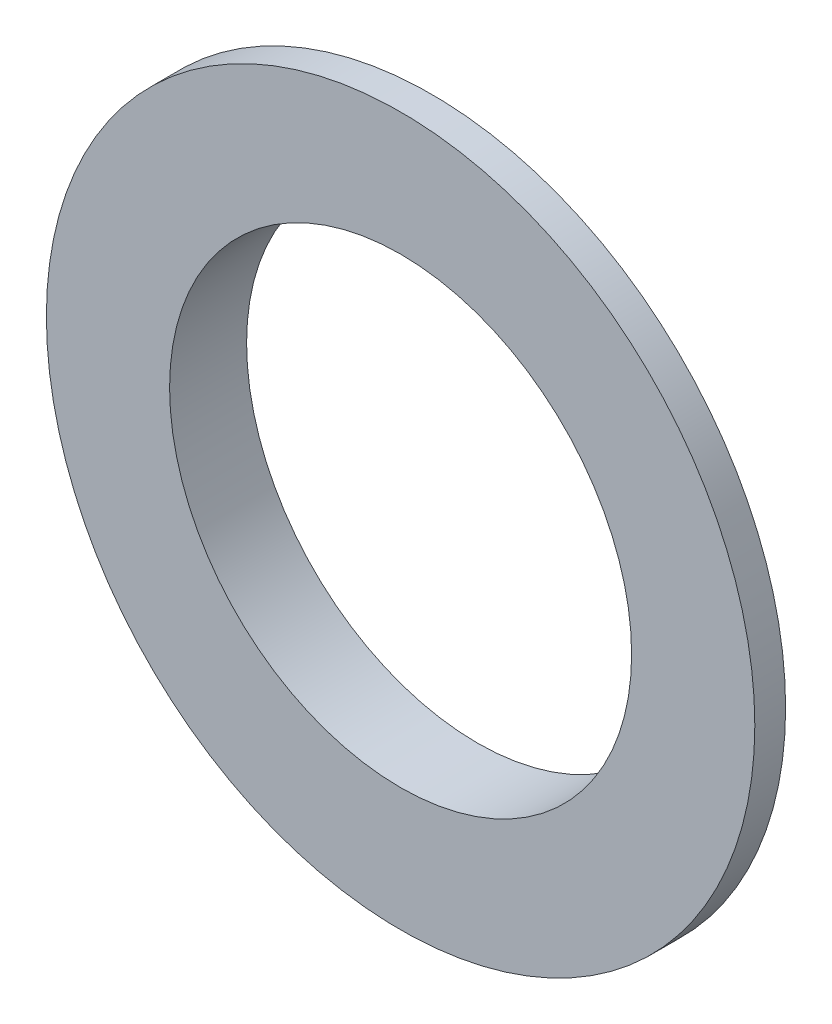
from build123d import *

# Parameters (mm, degrees)
ESQUISSE2_R             = 7.5
ENL_V_MAT_EXTRU_1_DEPTH = 17.454482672


with BuildPart() as part:
    # Esquisse1 → R_volution1 (revolve)
    with BuildSketch(Plane(origin=(0, 0, 0), x_dir=(0, 0, -1), z_dir=(1, 0, 0)), mode=Mode.PRIVATE) as r_volution1_sk:
        Polygon((0, 0), (0, 8.5), (-1.5, 8.5), (-1.5, 11.5), (-2.5, 11.5), (-2.5, 0), align=None)
    revolve(r_volution1_sk.sketch.rotate(Axis((0, 0, 0), (0, 0, 1)), 90), axis=Axis((0, 0, 0), (0, 0, 1)))

    # Esquisse2 → Enl_v. mat.-Extru.1 (cut, through all)
    with BuildSketch(Plane.XY.offset(2.5)):
        Circle(ESQUISSE2_R)
    extrude(amount=-ENL_V_MAT_EXTRU_1_DEPTH, mode=Mode.SUBTRACT)


solid = part.part
